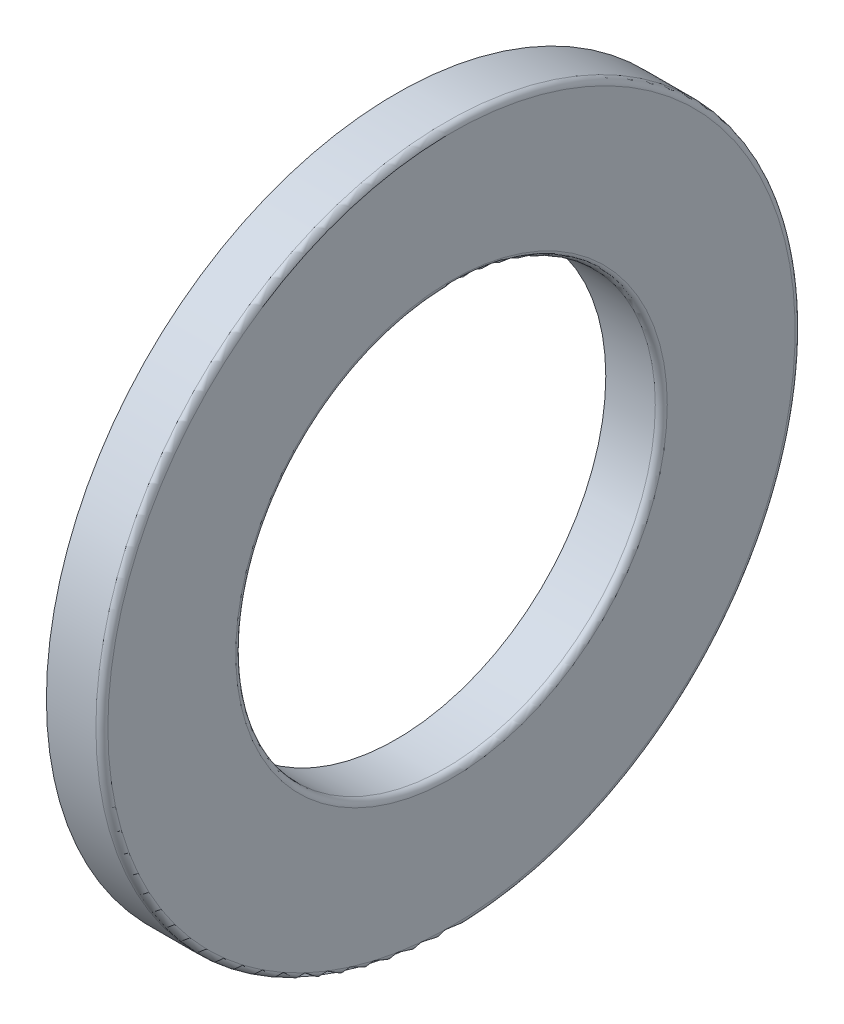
ISO-10303-21;
HEADER;
FILE_DESCRIPTION(('STEP AP214'),'2;1');
FILE_NAME('part.step','',(''),(''),'','','');
FILE_SCHEMA(('AUTOMOTIVE_DESIGN { 1 0 10303 214 1 1 1 1 }'));
ENDSEC;
DATA;
#1=APPLICATION_CONTEXT('core data for automotive mechanical design processes');
#2=APPLICATION_PROTOCOL_DEFINITION('international standard','automotive_design',2000,#1);
#3=PRODUCT_CONTEXT('',#1,'mechanical');
#4=PRODUCT('Part','Part','',(#3));
#5=PRODUCT_RELATED_PRODUCT_CATEGORY('part','',(#4));
#6=PRODUCT_DEFINITION_FORMATION('','',#4);
#7=PRODUCT_DEFINITION_CONTEXT('part definition',#1,'design');
#8=PRODUCT_DEFINITION('design','',#6,#7);
#9=PRODUCT_DEFINITION_SHAPE('','',#8);
#10=(LENGTH_UNIT() NAMED_UNIT(*) SI_UNIT(.MILLI.,.METRE.));
#11=(NAMED_UNIT(*) PLANE_ANGLE_UNIT() SI_UNIT($,.RADIAN.));
#12=(NAMED_UNIT(*) SI_UNIT($,.STERADIAN.) SOLID_ANGLE_UNIT());
#13=UNCERTAINTY_MEASURE_WITH_UNIT(LENGTH_MEASURE(1.E-05),#10,'distance_accuracy_value','');
#14=(GEOMETRIC_REPRESENTATION_CONTEXT(3) GLOBAL_UNCERTAINTY_ASSIGNED_CONTEXT((#13)) GLOBAL_UNIT_ASSIGNED_CONTEXT((#10,
#11,#12)) REPRESENTATION_CONTEXT('',''));
#15=CARTESIAN_POINT('',(0.,0.,0.));
#16=DIRECTION('',(0.,0.,1.));
#17=DIRECTION('',(1.,0.,0.));
#18=AXIS2_PLACEMENT_3D('',#15,#16,#17);
#19=CARTESIAN_POINT('',(7.2224,-17.8250860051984,-17.5));
#20=DIRECTION('',(-1.,0.,0.));
#21=DIRECTION('',(0.,0.,1.));
#22=AXIS2_PLACEMENT_3D('',#19,#20,#21);
#23=PLANE('',#22);
#24=CARTESIAN_POINT('',(7.2224,0.,0.));
#25=DIRECTION('',(-1.,0.,0.));
#26=DIRECTION('',(0.,0.,-1.));
#27=AXIS2_PLACEMENT_3D('',#24,#25,#26);
#28=CIRCLE('',#27,17.5);
#29=CARTESIAN_POINT('',(7.2224,0.,-17.5));
#30=VERTEX_POINT('',#29);
#31=EDGE_CURVE('E44',#30,#30,#28,.F.);
#32=ORIENTED_EDGE('',*,*,#31,.F.);
#33=EDGE_LOOP('',(#32));
#34=FACE_BOUND('',#33,.T.);
#35=CARTESIAN_POINT('',(7.2224,0.,0.));
#36=DIRECTION('',(1.,0.,0.));
#37=DIRECTION('',(0.,0.,1.));
#38=AXIS2_PLACEMENT_3D('',#35,#36,#37);
#39=CIRCLE('',#38,15.4168);
#40=CARTESIAN_POINT('',(7.2224,0.,15.4168));
#41=VERTEX_POINT('',#40);
#42=EDGE_CURVE('E41',#41,#41,#39,.T.);
#43=ORIENTED_EDGE('',*,*,#42,.T.);
#44=EDGE_LOOP('',(#43));
#45=FACE_BOUND('',#44,.T.);
#46=ADVANCED_FACE('F15',(#34,#45),#23,.T.);
#47=CARTESIAN_POINT('',(10.,-17.5195131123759,17.2));
#48=DIRECTION('',(1.,0.,0.));
#49=DIRECTION('',(0.,0.,-1.));
#50=AXIS2_PLACEMENT_3D('',#47,#48,#49);
#51=PLANE('',#50);
#52=CARTESIAN_POINT('',(10.,0.,0.));
#53=DIRECTION('',(1.,0.,0.));
#54=DIRECTION('',(0.,0.,1.));
#55=AXIS2_PLACEMENT_3D('',#52,#53,#54);
#56=CIRCLE('',#55,17.2);
#57=CARTESIAN_POINT('',(10.,0.,17.2));
#58=VERTEX_POINT('',#57);
#59=EDGE_CURVE('E38',#58,#58,#56,.T.);
#60=ORIENTED_EDGE('',*,*,#59,.T.);
#61=EDGE_LOOP('',(#60));
#62=FACE_BOUND('',#61,.T.);
#63=CARTESIAN_POINT('',(10.,0.,0.));
#64=DIRECTION('',(-1.,0.,0.));
#65=DIRECTION('',(0.,0.,-1.));
#66=AXIS2_PLACEMENT_3D('',#63,#64,#65);
#67=CIRCLE('',#66,10.8000000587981);
#68=CARTESIAN_POINT('',(10.,0.,-10.8000000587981));
#69=VERTEX_POINT('',#68);
#70=EDGE_CURVE('E35',#69,#69,#67,.F.);
#71=ORIENTED_EDGE('',*,*,#70,.F.);
#72=EDGE_LOOP('',(#71));
#73=FACE_BOUND('',#72,.T.);
#74=ADVANCED_FACE('F53',(#62,#73),#51,.T.);
#75=CARTESIAN_POINT('',(7.2224,-12.4133608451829,-12.0832));
#76=DIRECTION('',(-1.,0.,0.));
#77=DIRECTION('',(0.,0.,1.));
#78=AXIS2_PLACEMENT_3D('',#75,#76,#77);
#79=PLANE('',#78);
#80=CARTESIAN_POINT('',(7.2224,0.,0.));
#81=DIRECTION('',(-1.,0.,0.));
#82=DIRECTION('',(0.,0.,-1.));
#83=AXIS2_PLACEMENT_3D('',#80,#81,#82);
#84=CIRCLE('',#83,12.0832);
#85=CARTESIAN_POINT('',(7.2224,0.,-12.0832));
#86=VERTEX_POINT('',#85);
#87=EDGE_CURVE('E30',#86,#86,#84,.F.);
#88=ORIENTED_EDGE('',*,*,#87,.F.);
#89=EDGE_LOOP('',(#88));
#90=FACE_BOUND('',#89,.T.);
#91=CARTESIAN_POINT('',(7.2224,0.,0.));
#92=DIRECTION('',(1.,0.,0.));
#93=DIRECTION('',(0.,-1.16834000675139E-09,1.));
#94=AXIS2_PLACEMENT_3D('',#91,#92,#93);
#95=CIRCLE('',#94,10.5);
#96=CARTESIAN_POINT('',(7.2224,-1.22675700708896E-08,10.5));
#97=VERTEX_POINT('',#96);
#98=EDGE_CURVE('E26',#97,#97,#95,.T.);
#99=ORIENTED_EDGE('',*,*,#98,.T.);
#100=EDGE_LOOP('',(#99));
#101=FACE_BOUND('',#100,.T.);
#102=ADVANCED_FACE('F60',(#90,#101),#79,.T.);
#103=CARTESIAN_POINT('',(5.,0.,0.));
#104=DIRECTION('',(1.,0.,0.));
#105=DIRECTION('',(0.,0.,1.));
#106=AXIS2_PLACEMENT_3D('',#103,#104,#105);
#107=TOROIDAL_SURFACE('',#106,13.75,2.778);
#108=ORIENTED_EDGE('',*,*,#42,.F.);
#109=EDGE_LOOP('',(#108));
#110=FACE_BOUND('',#109,.T.);
#111=ORIENTED_EDGE('',*,*,#87,.T.);
#112=EDGE_LOOP('',(#111));
#113=FACE_BOUND('',#112,.T.);
#114=ADVANCED_FACE('F57',(#110,#113),#107,.F.);
#115=CARTESIAN_POINT('',(9.7,0.,0.));
#116=DIRECTION('',(1.,0.,0.));
#117=DIRECTION('',(0.,1.16853383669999E-09,1.));
#118=AXIS2_PLACEMENT_3D('',#115,#116,#117);
#119=CYLINDRICAL_SURFACE('',#118,17.5);
#120=ORIENTED_EDGE('',*,*,#31,.T.);
#121=EDGE_LOOP('',(#120));
#122=FACE_BOUND('',#121,.T.);
#123=CARTESIAN_POINT('',(9.7,0.,0.));
#124=DIRECTION('',(-1.,0.,0.));
#125=DIRECTION('',(0.,0.,-1.));
#126=AXIS2_PLACEMENT_3D('',#123,#124,#125);
#127=CIRCLE('',#126,17.5);
#128=CARTESIAN_POINT('',(9.7,0.,-17.5));
#129=VERTEX_POINT('',#128);
#130=EDGE_CURVE('E22',#129,#129,#127,.F.);
#131=ORIENTED_EDGE('',*,*,#130,.F.);
#132=EDGE_LOOP('',(#131));
#133=FACE_BOUND('',#132,.T.);
#134=ADVANCED_FACE('F48',(#122,#133),#119,.T.);
#135=CARTESIAN_POINT('',(9.70000000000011,0.,0.));
#136=DIRECTION('',(1.,0.,0.));
#137=DIRECTION('',(0.,0.,1.));
#138=AXIS2_PLACEMENT_3D('',#135,#136,#137);
#139=TOROIDAL_SURFACE('',#138,17.2,0.299999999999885);
#140=ORIENTED_EDGE('',*,*,#130,.T.);
#141=EDGE_LOOP('',(#140));
#142=FACE_BOUND('',#141,.T.);
#143=ORIENTED_EDGE('',*,*,#59,.F.);
#144=EDGE_LOOP('',(#143));
#145=FACE_BOUND('',#144,.T.);
#146=ADVANCED_FACE('F75',(#142,#145),#139,.T.);
#147=CARTESIAN_POINT('',(9.70000000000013,0.,0.));
#148=DIRECTION('',(1.,0.,0.));
#149=DIRECTION('',(0.,0.,1.));
#150=AXIS2_PLACEMENT_3D('',#147,#148,#149);
#151=TOROIDAL_SURFACE('',#150,10.7999999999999,0.299999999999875);
#152=ORIENTED_EDGE('',*,*,#70,.T.);
#153=EDGE_LOOP('',(#152));
#154=FACE_BOUND('',#153,.T.);
#155=CARTESIAN_POINT('',(9.7,0.,0.));
#156=DIRECTION('',(-1.,0.,0.));
#157=DIRECTION('',(0.,0.,-1.));
#158=AXIS2_PLACEMENT_3D('',#155,#156,#157);
#159=CIRCLE('',#158,10.5);
#160=CARTESIAN_POINT('',(9.7,0.,-10.5));
#161=VERTEX_POINT('',#160);
#162=EDGE_CURVE('E10',#161,#161,#159,.F.);
#163=ORIENTED_EDGE('',*,*,#162,.F.);
#164=EDGE_LOOP('',(#163));
#165=FACE_BOUND('',#164,.T.);
#166=ADVANCED_FACE('F70',(#154,#165),#151,.T.);
#167=CARTESIAN_POINT('',(9.7,0.,0.));
#168=DIRECTION('',(1.,0.,0.));
#169=DIRECTION('',(0.,0.,1.));
#170=AXIS2_PLACEMENT_3D('',#167,#168,#169);
#171=CYLINDRICAL_SURFACE('',#170,10.5);
#172=ORIENTED_EDGE('',*,*,#162,.T.);
#173=EDGE_LOOP('',(#172));
#174=FACE_BOUND('',#173,.T.);
#175=ORIENTED_EDGE('',*,*,#98,.F.);
#176=EDGE_LOOP('',(#175));
#177=FACE_BOUND('',#176,.T.);
#178=ADVANCED_FACE('F17',(#174,#177),#171,.F.);
#179=CLOSED_SHELL('',(#46,#74,#102,#114,#134,#146,#166,#178));
#180=MANIFOLD_SOLID_BREP('B1',#179);
#181=ADVANCED_BREP_SHAPE_REPRESENTATION('',(#18,#180),#14);
#182=SHAPE_DEFINITION_REPRESENTATION(#9,#181);
ENDSEC;
END-ISO-10303-21;
